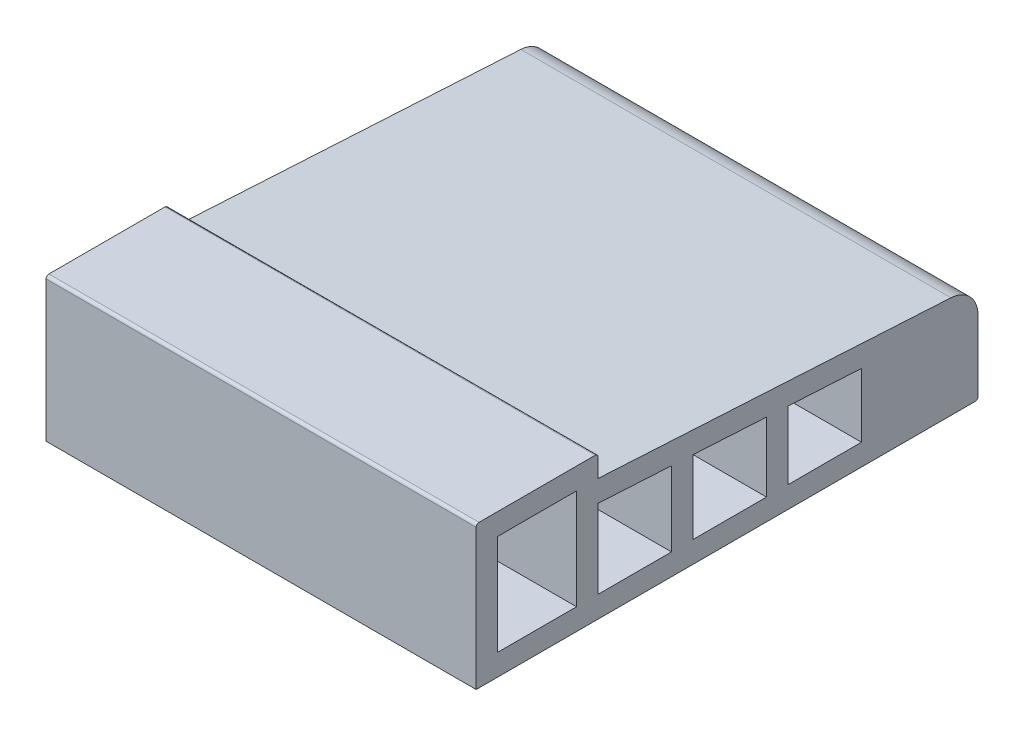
ISO-10303-21;
HEADER;
FILE_DESCRIPTION(('STEP AP214'),'2;1');
FILE_NAME('part.step','',(''),(''),'','','');
FILE_SCHEMA(('AUTOMOTIVE_DESIGN { 1 0 10303 214 1 1 1 1 }'));
ENDSEC;
DATA;
#1=APPLICATION_CONTEXT('core data for automotive mechanical design processes');
#2=APPLICATION_PROTOCOL_DEFINITION('international standard','automotive_design',2000,#1);
#3=PRODUCT_CONTEXT('',#1,'mechanical');
#4=PRODUCT('Part','Part','',(#3));
#5=PRODUCT_RELATED_PRODUCT_CATEGORY('part','',(#4));
#6=PRODUCT_DEFINITION_FORMATION('','',#4);
#7=PRODUCT_DEFINITION_CONTEXT('part definition',#1,'design');
#8=PRODUCT_DEFINITION('design','',#6,#7);
#9=PRODUCT_DEFINITION_SHAPE('','',#8);
#10=(LENGTH_UNIT() NAMED_UNIT(*) SI_UNIT(.MILLI.,.METRE.));
#11=(NAMED_UNIT(*) PLANE_ANGLE_UNIT() SI_UNIT($,.RADIAN.));
#12=(NAMED_UNIT(*) SI_UNIT($,.STERADIAN.) SOLID_ANGLE_UNIT());
#13=UNCERTAINTY_MEASURE_WITH_UNIT(LENGTH_MEASURE(1.E-05),#10,'distance_accuracy_value','');
#14=(GEOMETRIC_REPRESENTATION_CONTEXT(3) GLOBAL_UNCERTAINTY_ASSIGNED_CONTEXT((#13)) GLOBAL_UNIT_ASSIGNED_CONTEXT((#10,
#11,#12)) REPRESENTATION_CONTEXT('',''));
#15=CARTESIAN_POINT('',(0.,0.,0.));
#16=DIRECTION('',(0.,0.,1.));
#17=DIRECTION('',(1.,0.,0.));
#18=AXIS2_PLACEMENT_3D('',#15,#16,#17);
#19=CARTESIAN_POINT('',(30.,9.8,-8.3));
#20=DIRECTION('',(-1.,0.,0.));
#21=DIRECTION('',(0.,0.,1.));
#22=AXIS2_PLACEMENT_3D('',#19,#20,#21);
#23=PLANE('',#22);
#24=DIRECTION('',(0.,-1.,0.));
#25=VECTOR('',#24,1.);
#26=CARTESIAN_POINT('',(30.,1.5,-15.125));
#27=LINE('',#26,#25);
#28=CARTESIAN_POINT('',(30.,6.62259893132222,-15.125));
#29=VERTEX_POINT('',#28);
#30=CARTESIAN_POINT('',(30.,1.5,-15.125));
#31=VERTEX_POINT('',#30);
#32=EDGE_CURVE('E381',#29,#31,#27,.T.);
#33=ORIENTED_EDGE('',*,*,#32,.F.);
#34=DIRECTION('',(0.,0.0565133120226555,0.998401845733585));
#35=VECTOR('',#34,1.);
#36=CARTESIAN_POINT('',(30.,6.33250459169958,-20.25));
#37=LINE('',#36,#35);
#38=CARTESIAN_POINT('',(30.,6.33250459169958,-20.25));
#39=VERTEX_POINT('',#38);
#40=EDGE_CURVE('E375',#39,#29,#37,.T.);
#41=ORIENTED_EDGE('',*,*,#40,.F.);
#42=DIRECTION('',(0.,1.,0.));
#43=VECTOR('',#42,1.);
#44=CARTESIAN_POINT('',(30.,1.5,-20.25));
#45=LINE('',#44,#43);
#46=CARTESIAN_POINT('',(30.,1.5,-20.25));
#47=VERTEX_POINT('',#46);
#48=EDGE_CURVE('E394',#47,#39,#45,.T.);
#49=ORIENTED_EDGE('',*,*,#48,.F.);
#50=DIRECTION('',(0.,0.,-1.));
#51=VECTOR('',#50,1.);
#52=CARTESIAN_POINT('',(30.,1.5,-15.125));
#53=LINE('',#52,#51);
#54=EDGE_CURVE('E405',#31,#47,#53,.T.);
#55=ORIENTED_EDGE('',*,*,#54,.F.);
#56=EDGE_LOOP('',(#33,#41,#49,#55));
#57=FACE_BOUND('',#56,.T.);
#58=DIRECTION('',(0.,-1.,0.));
#59=VECTOR('',#58,1.);
#60=CARTESIAN_POINT('',(30.,8.5,-1.5));
#61=LINE('',#60,#59);
#62=CARTESIAN_POINT('',(30.,8.5,-1.5));
#63=VERTEX_POINT('',#62);
#64=CARTESIAN_POINT('',(30.,1.5,-1.5));
#65=VERTEX_POINT('',#64);
#66=EDGE_CURVE('E232',#63,#65,#61,.T.);
#67=ORIENTED_EDGE('',*,*,#66,.F.);
#68=DIRECTION('',(0.,0.,1.));
#69=VECTOR('',#68,1.);
#70=CARTESIAN_POINT('',(30.,8.5,-1.5));
#71=LINE('',#70,#69);
#72=CARTESIAN_POINT('',(30.,8.5,-7.));
#73=VERTEX_POINT('',#72);
#74=EDGE_CURVE('E240',#73,#63,#71,.T.);
#75=ORIENTED_EDGE('',*,*,#74,.F.);
#76=DIRECTION('',(0.,1.,0.));
#77=VECTOR('',#76,1.);
#78=CARTESIAN_POINT('',(30.,8.5,-7.));
#79=LINE('',#78,#77);
#80=CARTESIAN_POINT('',(30.,1.5,-7.));
#81=VERTEX_POINT('',#80);
#82=EDGE_CURVE('E237',#81,#73,#79,.T.);
#83=ORIENTED_EDGE('',*,*,#82,.F.);
#84=DIRECTION('',(0.,0.,-1.));
#85=VECTOR('',#84,1.);
#86=CARTESIAN_POINT('',(30.,1.5,-1.5));
#87=LINE('',#86,#85);
#88=EDGE_CURVE('E234',#65,#81,#87,.T.);
#89=ORIENTED_EDGE('',*,*,#88,.F.);
#90=EDGE_LOOP('',(#67,#75,#83,#89));
#91=FACE_BOUND('',#90,.T.);
#92=DIRECTION('',(0.,1.,0.));
#93=VECTOR('',#92,1.);
#94=CARTESIAN_POINT('',(30.,8.5,-8.5));
#95=LINE('',#94,#93);
#96=CARTESIAN_POINT('',(30.,8.5,-8.5));
#97=VERTEX_POINT('',#96);
#98=CARTESIAN_POINT('',(30.,9.8,-8.5));
#99=VERTEX_POINT('',#98);
#100=EDGE_CURVE('E265',#97,#99,#95,.T.);
#101=ORIENTED_EDGE('',*,*,#100,.T.);
#102=CARTESIAN_POINT('',(30.,9.8,-8.3));
#103=DIRECTION('',(1.,0.,0.));
#104=DIRECTION('',(0.,0.,1.));
#105=AXIS2_PLACEMENT_3D('',#102,#103,#104);
#106=CIRCLE('',#105,0.200000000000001);
#107=CARTESIAN_POINT('',(30.,10.,-8.3));
#108=VERTEX_POINT('',#107);
#109=EDGE_CURVE('E268',#99,#108,#106,.T.);
#110=ORIENTED_EDGE('',*,*,#109,.T.);
#111=DIRECTION('',(0.,0.,1.));
#112=VECTOR('',#111,1.);
#113=CARTESIAN_POINT('',(30.,10.,-0.200000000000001));
#114=LINE('',#113,#112);
#115=CARTESIAN_POINT('',(30.,10.,-0.200000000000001));
#116=VERTEX_POINT('',#115);
#117=EDGE_CURVE('E270',#108,#116,#114,.T.);
#118=ORIENTED_EDGE('',*,*,#117,.T.);
#119=CARTESIAN_POINT('',(30.,9.8,-0.2));
#120=DIRECTION('',(1.,0.,0.));
#121=DIRECTION('',(0.,0.,1.));
#122=AXIS2_PLACEMENT_3D('',#119,#120,#121);
#123=CIRCLE('',#122,0.2);
#124=CARTESIAN_POINT('',(30.,9.8,0.));
#125=VERTEX_POINT('',#124);
#126=EDGE_CURVE('E272',#116,#125,#123,.T.);
#127=ORIENTED_EDGE('',*,*,#126,.T.);
#128=DIRECTION('',(0.,-1.,0.));
#129=VECTOR('',#128,1.);
#130=CARTESIAN_POINT('',(30.,0.,0.));
#131=LINE('',#130,#129);
#132=CARTESIAN_POINT('',(30.,0.,0.));
#133=VERTEX_POINT('',#132);
#134=EDGE_CURVE('E274',#125,#133,#131,.T.);
#135=ORIENTED_EDGE('',*,*,#134,.T.);
#136=DIRECTION('',(0.,0.,-1.));
#137=VECTOR('',#136,1.);
#138=CARTESIAN_POINT('',(30.,0.,-34.8));
#139=LINE('',#138,#137);
#140=CARTESIAN_POINT('',(30.,0.,-34.8));
#141=VERTEX_POINT('',#140);
#142=EDGE_CURVE('E276',#133,#141,#139,.T.);
#143=ORIENTED_EDGE('',*,*,#142,.T.);
#144=CARTESIAN_POINT('',(30.,0.2,-34.8));
#145=DIRECTION('',(1.,0.,0.));
#146=DIRECTION('',(0.,0.,1.));
#147=AXIS2_PLACEMENT_3D('',#144,#145,#146);
#148=CIRCLE('',#147,0.199999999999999);
#149=CARTESIAN_POINT('',(30.,0.200000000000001,-35.));
#150=VERTEX_POINT('',#149);
#151=EDGE_CURVE('E278',#141,#150,#148,.T.);
#152=ORIENTED_EDGE('',*,*,#151,.T.);
#153=DIRECTION('',(0.,1.,0.));
#154=VECTOR('',#153,1.);
#155=CARTESIAN_POINT('',(30.,5.1100061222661,-35.));
#156=LINE('',#155,#154);
#157=CARTESIAN_POINT('',(30.,5.1100061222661,-35.));
#158=VERTEX_POINT('',#157);
#159=EDGE_CURVE('E280',#150,#158,#156,.T.);
#160=ORIENTED_EDGE('',*,*,#159,.T.);
#161=CARTESIAN_POINT('',(30.,5.11000612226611,-33.));
#162=DIRECTION('',(1.,0.,0.));
#163=DIRECTION('',(0.,0.,1.));
#164=AXIS2_PLACEMENT_3D('',#161,#162,#163);
#165=CIRCLE('',#164,2.);
#166=CARTESIAN_POINT('',(30.,7.10680981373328,-33.1130266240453));
#167=VERTEX_POINT('',#166);
#168=EDGE_CURVE('E282',#158,#167,#165,.T.);
#169=ORIENTED_EDGE('',*,*,#168,.T.);
#170=DIRECTION('',(0.,0.0565133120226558,0.998401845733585));
#171=VECTOR('',#170,1.);
#172=CARTESIAN_POINT('',(30.,8.5,-8.5));
#173=LINE('',#172,#171);
#174=EDGE_CURVE('E284',#167,#97,#173,.T.);
#175=ORIENTED_EDGE('',*,*,#174,.T.);
#176=EDGE_LOOP('',(#101,#110,#118,#127,#135,#143,#152,#160,#169,#175));
#177=FACE_BOUND('',#176,.T.);
#178=DIRECTION('',(0.,0.0565133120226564,0.998401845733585));
#179=VECTOR('',#178,1.);
#180=CARTESIAN_POINT('',(30.,6.70750459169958,-13.625));
#181=LINE('',#180,#179);
#182=CARTESIAN_POINT('',(30.,6.70750459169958,-13.625));
#183=VERTEX_POINT('',#182);
#184=CARTESIAN_POINT('',(30.,6.99759893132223,-8.5));
#185=VERTEX_POINT('',#184);
#186=EDGE_CURVE('E227',#183,#185,#181,.T.);
#187=ORIENTED_EDGE('',*,*,#186,.F.);
#188=DIRECTION('',(0.,1.,0.));
#189=VECTOR('',#188,1.);
#190=CARTESIAN_POINT('',(30.,1.5,-13.625));
#191=LINE('',#190,#189);
#192=CARTESIAN_POINT('',(30.,1.5,-13.625));
#193=VERTEX_POINT('',#192);
#194=EDGE_CURVE('E207',#193,#183,#191,.T.);
#195=ORIENTED_EDGE('',*,*,#194,.F.);
#196=DIRECTION('',(0.,0.,-1.));
#197=VECTOR('',#196,1.);
#198=CARTESIAN_POINT('',(30.,1.5,-8.5));
#199=LINE('',#198,#197);
#200=CARTESIAN_POINT('',(30.,1.5,-8.5));
#201=VERTEX_POINT('',#200);
#202=EDGE_CURVE('E219',#201,#193,#199,.T.);
#203=ORIENTED_EDGE('',*,*,#202,.F.);
#204=DIRECTION('',(0.,-1.,0.));
#205=VECTOR('',#204,1.);
#206=CARTESIAN_POINT('',(30.,1.5,-8.5));
#207=LINE('',#206,#205);
#208=EDGE_CURVE('E223',#185,#201,#207,.T.);
#209=ORIENTED_EDGE('',*,*,#208,.F.);
#210=EDGE_LOOP('',(#187,#195,#203,#209));
#211=FACE_BOUND('',#210,.T.);
#212=DIRECTION('',(0.,0.,-1.));
#213=VECTOR('',#212,1.);
#214=CARTESIAN_POINT('',(30.,1.5,-26.875));
#215=LINE('',#214,#213);
#216=CARTESIAN_POINT('',(30.,1.5,-21.75));
#217=VERTEX_POINT('',#216);
#218=CARTESIAN_POINT('',(30.,1.5,-26.875));
#219=VERTEX_POINT('',#218);
#220=EDGE_CURVE('E331',#217,#219,#215,.T.);
#221=ORIENTED_EDGE('',*,*,#220,.F.);
#222=DIRECTION('',(0.,-1.,0.));
#223=VECTOR('',#222,1.);
#224=CARTESIAN_POINT('',(30.,1.5,-21.75));
#225=LINE('',#224,#223);
#226=CARTESIAN_POINT('',(30.,6.24759893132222,-21.75));
#227=VERTEX_POINT('',#226);
#228=EDGE_CURVE('E111',#227,#217,#225,.T.);
#229=ORIENTED_EDGE('',*,*,#228,.F.);
#230=DIRECTION('',(0.,0.0565133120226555,0.998401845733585));
#231=VECTOR('',#230,1.);
#232=CARTESIAN_POINT('',(30.,5.95750459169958,-26.875));
#233=LINE('',#232,#231);
#234=CARTESIAN_POINT('',(30.,5.95750459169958,-26.875));
#235=VERTEX_POINT('',#234);
#236=EDGE_CURVE('E434',#235,#227,#233,.T.);
#237=ORIENTED_EDGE('',*,*,#236,.F.);
#238=DIRECTION('',(0.,1.,0.));
#239=VECTOR('',#238,1.);
#240=CARTESIAN_POINT('',(30.,1.5,-26.875));
#241=LINE('',#240,#239);
#242=EDGE_CURVE('E432',#219,#235,#241,.T.);
#243=ORIENTED_EDGE('',*,*,#242,.F.);
#244=EDGE_LOOP('',(#221,#229,#237,#243));
#245=FACE_BOUND('',#244,.T.);
#246=ADVANCED_FACE('F26',(#57,#91,#177,#211,#245),#23,.F.);
#247=CARTESIAN_POINT('',(0.,9.8,-8.3));
#248=DIRECTION('',(-1.,0.,0.));
#249=DIRECTION('',(0.,0.,1.));
#250=AXIS2_PLACEMENT_3D('',#247,#248,#249);
#251=PLANE('',#250);
#252=DIRECTION('',(0.,0.0565133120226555,0.998401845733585));
#253=VECTOR('',#252,1.);
#254=CARTESIAN_POINT('',(0.,6.49501863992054,-8.11292558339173));
#255=LINE('',#254,#253);
#256=CARTESIAN_POINT('',(0.,5.8376551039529,-19.7263480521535));
#257=VERTEX_POINT('',#256);
#258=CARTESIAN_POINT('',(0.,6.06846809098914,-15.6486519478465));
#259=VERTEX_POINT('',#258);
#260=EDGE_CURVE('E379',#257,#259,#255,.T.);
#261=ORIENTED_EDGE('',*,*,#260,.T.);
#262=DIRECTION('',(0.,-1.,0.));
#263=VECTOR('',#262,1.);
#264=CARTESIAN_POINT('',(0.,9.8,-15.6486519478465));
#265=LINE('',#264,#263);
#266=CARTESIAN_POINT('',(0.,2.02365194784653,-15.6486519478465));
#267=VERTEX_POINT('',#266);
#268=EDGE_CURVE('E315',#259,#267,#265,.T.);
#269=ORIENTED_EDGE('',*,*,#268,.T.);
#270=DIRECTION('',(0.,0.,-1.));
#271=VECTOR('',#270,1.);
#272=CARTESIAN_POINT('',(0.,2.02365194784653,-8.3));
#273=LINE('',#272,#271);
#274=CARTESIAN_POINT('',(0.,2.02365194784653,-19.7263480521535));
#275=VERTEX_POINT('',#274);
#276=EDGE_CURVE('E30',#267,#275,#273,.T.);
#277=ORIENTED_EDGE('',*,*,#276,.T.);
#278=DIRECTION('',(0.,1.,0.));
#279=VECTOR('',#278,1.);
#280=CARTESIAN_POINT('',(0.,9.8,-19.7263480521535));
#281=LINE('',#280,#279);
#282=EDGE_CURVE('E376',#275,#257,#281,.T.);
#283=ORIENTED_EDGE('',*,*,#282,.T.);
#284=EDGE_LOOP('',(#261,#269,#277,#283));
#285=FACE_BOUND('',#284,.T.);
#286=DIRECTION('',(0.,0.,1.));
#287=VECTOR('',#286,1.);
#288=CARTESIAN_POINT('',(0.,7.97634805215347,-8.3));
#289=LINE('',#288,#287);
#290=CARTESIAN_POINT('',(0.,7.97634805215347,-6.47634805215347));
#291=VERTEX_POINT('',#290);
#292=CARTESIAN_POINT('',(0.,7.97634805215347,-2.02365194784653));
#293=VERTEX_POINT('',#292);
#294=EDGE_CURVE('E235',#291,#293,#289,.T.);
#295=ORIENTED_EDGE('',*,*,#294,.T.);
#296=DIRECTION('',(0.,-1.,0.));
#297=VECTOR('',#296,1.);
#298=CARTESIAN_POINT('',(0.,9.8,-2.02365194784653));
#299=LINE('',#298,#297);
#300=CARTESIAN_POINT('',(0.,2.02365194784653,-2.02365194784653));
#301=VERTEX_POINT('',#300);
#302=EDGE_CURVE('E348',#293,#301,#299,.T.);
#303=ORIENTED_EDGE('',*,*,#302,.T.);
#304=DIRECTION('',(0.,0.,-1.));
#305=VECTOR('',#304,1.);
#306=CARTESIAN_POINT('',(0.,2.02365194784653,-8.3));
#307=LINE('',#306,#305);
#308=CARTESIAN_POINT('',(0.,2.02365194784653,-6.47634805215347));
#309=VERTEX_POINT('',#308);
#310=EDGE_CURVE('E345',#301,#309,#307,.T.);
#311=ORIENTED_EDGE('',*,*,#310,.T.);
#312=DIRECTION('',(0.,1.,0.));
#313=VECTOR('',#312,1.);
#314=CARTESIAN_POINT('',(0.,9.8,-6.47634805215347));
#315=LINE('',#314,#313);
#316=EDGE_CURVE('E342',#309,#291,#315,.T.);
#317=ORIENTED_EDGE('',*,*,#316,.T.);
#318=EDGE_LOOP('',(#295,#303,#311,#317));
#319=FACE_BOUND('',#318,.T.);
#320=DIRECTION('',(0.,1.,0.));
#321=VECTOR('',#320,1.);
#322=CARTESIAN_POINT('',(0.,8.5,-8.5));
#323=LINE('',#322,#321);
#324=CARTESIAN_POINT('',(0.,8.5,-8.5));
#325=VERTEX_POINT('',#324);
#326=CARTESIAN_POINT('',(0.,9.8,-8.5));
#327=VERTEX_POINT('',#326);
#328=EDGE_CURVE('E243',#325,#327,#323,.T.);
#329=ORIENTED_EDGE('',*,*,#328,.F.);
#330=DIRECTION('',(0.,0.0565133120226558,0.998401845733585));
#331=VECTOR('',#330,1.);
#332=CARTESIAN_POINT('',(0.,8.5,-8.5));
#333=LINE('',#332,#331);
#334=CARTESIAN_POINT('',(0.,7.10680981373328,-33.1130266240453));
#335=VERTEX_POINT('',#334);
#336=EDGE_CURVE('E263',#335,#325,#333,.T.);
#337=ORIENTED_EDGE('',*,*,#336,.F.);
#338=CARTESIAN_POINT('',(0.,5.11000612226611,-33.));
#339=DIRECTION('',(1.,0.,0.));
#340=DIRECTION('',(0.,0.,1.));
#341=AXIS2_PLACEMENT_3D('',#338,#339,#340);
#342=CIRCLE('',#341,2.);
#343=CARTESIAN_POINT('',(0.,5.1100061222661,-35.));
#344=VERTEX_POINT('',#343);
#345=EDGE_CURVE('E261',#344,#335,#342,.T.);
#346=ORIENTED_EDGE('',*,*,#345,.F.);
#347=DIRECTION('',(0.,1.,0.));
#348=VECTOR('',#347,1.);
#349=CARTESIAN_POINT('',(0.,5.1100061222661,-35.));
#350=LINE('',#349,#348);
#351=CARTESIAN_POINT('',(0.,0.200000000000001,-35.));
#352=VERTEX_POINT('',#351);
#353=EDGE_CURVE('E259',#352,#344,#350,.T.);
#354=ORIENTED_EDGE('',*,*,#353,.F.);
#355=CARTESIAN_POINT('',(0.,0.2,-34.8));
#356=DIRECTION('',(1.,0.,0.));
#357=DIRECTION('',(0.,0.,1.));
#358=AXIS2_PLACEMENT_3D('',#355,#356,#357);
#359=CIRCLE('',#358,0.199999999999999);
#360=CARTESIAN_POINT('',(0.,0.,-34.8));
#361=VERTEX_POINT('',#360);
#362=EDGE_CURVE('E257',#361,#352,#359,.T.);
#363=ORIENTED_EDGE('',*,*,#362,.F.);
#364=DIRECTION('',(0.,0.,-1.));
#365=VECTOR('',#364,1.);
#366=CARTESIAN_POINT('',(0.,0.,-34.8));
#367=LINE('',#366,#365);
#368=CARTESIAN_POINT('',(0.,0.,0.));
#369=VERTEX_POINT('',#368);
#370=EDGE_CURVE('E255',#369,#361,#367,.T.);
#371=ORIENTED_EDGE('',*,*,#370,.F.);
#372=DIRECTION('',(0.,-1.,0.));
#373=VECTOR('',#372,1.);
#374=CARTESIAN_POINT('',(0.,0.,0.));
#375=LINE('',#374,#373);
#376=CARTESIAN_POINT('',(0.,9.8,0.));
#377=VERTEX_POINT('',#376);
#378=EDGE_CURVE('E253',#377,#369,#375,.T.);
#379=ORIENTED_EDGE('',*,*,#378,.F.);
#380=CARTESIAN_POINT('',(0.,9.8,-0.2));
#381=DIRECTION('',(1.,0.,0.));
#382=DIRECTION('',(0.,0.,1.));
#383=AXIS2_PLACEMENT_3D('',#380,#381,#382);
#384=CIRCLE('',#383,0.2);
#385=CARTESIAN_POINT('',(0.,10.,-0.200000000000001));
#386=VERTEX_POINT('',#385);
#387=EDGE_CURVE('E251',#386,#377,#384,.T.);
#388=ORIENTED_EDGE('',*,*,#387,.F.);
#389=DIRECTION('',(0.,0.,1.));
#390=VECTOR('',#389,1.);
#391=CARTESIAN_POINT('',(0.,10.,-0.200000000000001));
#392=LINE('',#391,#390);
#393=CARTESIAN_POINT('',(0.,10.,-8.3));
#394=VERTEX_POINT('',#393);
#395=EDGE_CURVE('E249',#394,#386,#392,.T.);
#396=ORIENTED_EDGE('',*,*,#395,.F.);
#397=CARTESIAN_POINT('',(0.,9.8,-8.3));
#398=DIRECTION('',(1.,0.,0.));
#399=DIRECTION('',(0.,0.,1.));
#400=AXIS2_PLACEMENT_3D('',#397,#398,#399);
#401=CIRCLE('',#400,0.200000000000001);
#402=EDGE_CURVE('E246',#327,#394,#401,.T.);
#403=ORIENTED_EDGE('',*,*,#402,.F.);
#404=EDGE_LOOP('',(#329,#337,#346,#354,#363,#371,#379,#388,#396,#403));
#405=FACE_BOUND('',#404,.T.);
#406=DIRECTION('',(0.,1.,0.));
#407=VECTOR('',#406,1.);
#408=CARTESIAN_POINT('',(0.,9.8,-13.1013480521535));
#409=LINE('',#408,#407);
#410=CARTESIAN_POINT('',(0.,2.02365194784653,-13.1013480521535));
#411=VERTEX_POINT('',#410);
#412=CARTESIAN_POINT('',(0.,6.2126551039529,-13.1013480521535));
#413=VERTEX_POINT('',#412);
#414=EDGE_CURVE('E210',#411,#413,#409,.T.);
#415=ORIENTED_EDGE('',*,*,#414,.T.);
#416=DIRECTION('',(0.,0.0565133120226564,0.998401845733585));
#417=VECTOR('',#416,1.);
#418=CARTESIAN_POINT('',(0.,6.49501863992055,-8.11292558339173));
#419=LINE('',#418,#417);
#420=CARTESIAN_POINT('',(0.,6.44346809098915,-9.02365194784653));
#421=VERTEX_POINT('',#420);
#422=EDGE_CURVE('E359',#413,#421,#419,.T.);
#423=ORIENTED_EDGE('',*,*,#422,.T.);
#424=DIRECTION('',(0.,-1.,0.));
#425=VECTOR('',#424,1.);
#426=CARTESIAN_POINT('',(0.,9.8,-9.02365194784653));
#427=LINE('',#426,#425);
#428=CARTESIAN_POINT('',(0.,2.02365194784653,-9.02365194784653));
#429=VERTEX_POINT('',#428);
#430=EDGE_CURVE('E362',#421,#429,#427,.T.);
#431=ORIENTED_EDGE('',*,*,#430,.T.);
#432=DIRECTION('',(0.,0.,-1.));
#433=VECTOR('',#432,1.);
#434=CARTESIAN_POINT('',(0.,2.02365194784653,-8.3));
#435=LINE('',#434,#433);
#436=EDGE_CURVE('E358',#429,#411,#435,.T.);
#437=ORIENTED_EDGE('',*,*,#436,.T.);
#438=EDGE_LOOP('',(#415,#423,#431,#437));
#439=FACE_BOUND('',#438,.T.);
#440=DIRECTION('',(0.,-1.,0.));
#441=VECTOR('',#440,1.);
#442=CARTESIAN_POINT('',(0.,9.8,-22.2736519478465));
#443=LINE('',#442,#441);
#444=CARTESIAN_POINT('',(0.,5.69346809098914,-22.2736519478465));
#445=VERTEX_POINT('',#444);
#446=CARTESIAN_POINT('',(0.,2.02365194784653,-22.2736519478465));
#447=VERTEX_POINT('',#446);
#448=EDGE_CURVE('E328',#445,#447,#443,.T.);
#449=ORIENTED_EDGE('',*,*,#448,.T.);
#450=DIRECTION('',(0.,0.,-1.));
#451=VECTOR('',#450,1.);
#452=CARTESIAN_POINT('',(0.,2.02365194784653,-8.3));
#453=LINE('',#452,#451);
#454=CARTESIAN_POINT('',(0.,2.02365194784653,-26.3513480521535));
#455=VERTEX_POINT('',#454);
#456=EDGE_CURVE('E325',#447,#455,#453,.T.);
#457=ORIENTED_EDGE('',*,*,#456,.T.);
#458=DIRECTION('',(0.,1.,0.));
#459=VECTOR('',#458,1.);
#460=CARTESIAN_POINT('',(0.,9.80000000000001,-26.3513480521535));
#461=LINE('',#460,#459);
#462=CARTESIAN_POINT('',(0.,5.4626551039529,-26.3513480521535));
#463=VERTEX_POINT('',#462);
#464=EDGE_CURVE('E321',#455,#463,#461,.T.);
#465=ORIENTED_EDGE('',*,*,#464,.T.);
#466=DIRECTION('',(0.,0.0565133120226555,0.998401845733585));
#467=VECTOR('',#466,1.);
#468=CARTESIAN_POINT('',(0.,6.49501863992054,-8.11292558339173));
#469=LINE('',#468,#467);
#470=EDGE_CURVE('E324',#463,#445,#469,.T.);
#471=ORIENTED_EDGE('',*,*,#470,.T.);
#472=EDGE_LOOP('',(#449,#457,#465,#471));
#473=FACE_BOUND('',#472,.T.);
#474=ADVANCED_FACE('F384',(#285,#319,#405,#439,#473),#251,.T.);
#475=CARTESIAN_POINT('',(30.,8.5,-8.5));
#476=DIRECTION('',(0.,0.,1.));
#477=DIRECTION('',(0.,-1.,0.));
#478=AXIS2_PLACEMENT_3D('',#475,#476,#477);
#479=PLANE('',#478);
#480=ORIENTED_EDGE('',*,*,#328,.T.);
#481=DIRECTION('',(-1.,0.,0.));
#482=VECTOR('',#481,1.);
#483=CARTESIAN_POINT('',(30.,9.8,-8.5));
#484=LINE('',#483,#482);
#485=EDGE_CURVE('E11',#99,#327,#484,.T.);
#486=ORIENTED_EDGE('',*,*,#485,.F.);
#487=ORIENTED_EDGE('',*,*,#100,.F.);
#488=DIRECTION('',(-1.,0.,0.));
#489=VECTOR('',#488,1.);
#490=CARTESIAN_POINT('',(30.,8.5,-8.5));
#491=LINE('',#490,#489);
#492=EDGE_CURVE('E286',#97,#325,#491,.T.);
#493=ORIENTED_EDGE('',*,*,#492,.T.);
#494=EDGE_LOOP('',(#480,#486,#487,#493));
#495=FACE_BOUND('',#494,.T.);
#496=ADVANCED_FACE('F421',(#495),#479,.F.);
#497=CARTESIAN_POINT('',(30.,9.8,-8.3));
#498=DIRECTION('',(-1.,0.,0.));
#499=DIRECTION('',(0.,0.,1.));
#500=AXIS2_PLACEMENT_3D('',#497,#498,#499);
#501=CYLINDRICAL_SURFACE('',#500,0.200000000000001);
#502=ORIENTED_EDGE('',*,*,#402,.T.);
#503=DIRECTION('',(-1.,0.,0.));
#504=VECTOR('',#503,1.);
#505=CARTESIAN_POINT('',(30.,10.,-8.3));
#506=LINE('',#505,#504);
#507=EDGE_CURVE('E36',#108,#394,#506,.T.);
#508=ORIENTED_EDGE('',*,*,#507,.F.);
#509=ORIENTED_EDGE('',*,*,#109,.F.);
#510=ORIENTED_EDGE('',*,*,#485,.T.);
#511=EDGE_LOOP('',(#502,#508,#509,#510));
#512=FACE_BOUND('',#511,.T.);
#513=ADVANCED_FACE('F487',(#512),#501,.T.);
#514=CARTESIAN_POINT('',(30.,10.,-0.200000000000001));
#515=DIRECTION('',(0.,-1.,0.));
#516=DIRECTION('',(0.,0.,-1.));
#517=AXIS2_PLACEMENT_3D('',#514,#515,#516);
#518=PLANE('',#517);
#519=ORIENTED_EDGE('',*,*,#395,.T.);
#520=DIRECTION('',(-1.,0.,0.));
#521=VECTOR('',#520,1.);
#522=CARTESIAN_POINT('',(30.,10.,-0.200000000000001));
#523=LINE('',#522,#521);
#524=EDGE_CURVE('E307',#116,#386,#523,.T.);
#525=ORIENTED_EDGE('',*,*,#524,.F.);
#526=ORIENTED_EDGE('',*,*,#117,.F.);
#527=ORIENTED_EDGE('',*,*,#507,.T.);
#528=EDGE_LOOP('',(#519,#525,#526,#527));
#529=FACE_BOUND('',#528,.T.);
#530=ADVANCED_FACE('F483',(#529),#518,.F.);
#531=CARTESIAN_POINT('',(30.,9.8,-0.2));
#532=DIRECTION('',(-1.,0.,0.));
#533=DIRECTION('',(0.,0.,1.));
#534=AXIS2_PLACEMENT_3D('',#531,#532,#533);
#535=CYLINDRICAL_SURFACE('',#534,0.2);
#536=ORIENTED_EDGE('',*,*,#387,.T.);
#537=DIRECTION('',(-1.,0.,0.));
#538=VECTOR('',#537,1.);
#539=CARTESIAN_POINT('',(30.,9.8,0.));
#540=LINE('',#539,#538);
#541=EDGE_CURVE('E304',#125,#377,#540,.T.);
#542=ORIENTED_EDGE('',*,*,#541,.F.);
#543=ORIENTED_EDGE('',*,*,#126,.F.);
#544=ORIENTED_EDGE('',*,*,#524,.T.);
#545=EDGE_LOOP('',(#536,#542,#543,#544));
#546=FACE_BOUND('',#545,.T.);
#547=ADVANCED_FACE('F479',(#546),#535,.T.);
#548=CARTESIAN_POINT('',(30.,0.,0.));
#549=DIRECTION('',(0.,0.,-1.));
#550=DIRECTION('',(-1.,0.,0.));
#551=AXIS2_PLACEMENT_3D('',#548,#549,#550);
#552=PLANE('',#551);
#553=ORIENTED_EDGE('',*,*,#378,.T.);
#554=DIRECTION('',(-1.,0.,0.));
#555=VECTOR('',#554,1.);
#556=CARTESIAN_POINT('',(30.,0.,0.));
#557=LINE('',#556,#555);
#558=EDGE_CURVE('E301',#133,#369,#557,.T.);
#559=ORIENTED_EDGE('',*,*,#558,.F.);
#560=ORIENTED_EDGE('',*,*,#134,.F.);
#561=ORIENTED_EDGE('',*,*,#541,.T.);
#562=EDGE_LOOP('',(#553,#559,#560,#561));
#563=FACE_BOUND('',#562,.T.);
#564=ADVANCED_FACE('F475',(#563),#552,.F.);
#565=CARTESIAN_POINT('',(30.,0.,-34.8));
#566=DIRECTION('',(0.,1.,0.));
#567=DIRECTION('',(0.,0.,1.));
#568=AXIS2_PLACEMENT_3D('',#565,#566,#567);
#569=PLANE('',#568);
#570=ORIENTED_EDGE('',*,*,#370,.T.);
#571=DIRECTION('',(-1.,0.,0.));
#572=VECTOR('',#571,1.);
#573=CARTESIAN_POINT('',(30.,0.,-34.8));
#574=LINE('',#573,#572);
#575=EDGE_CURVE('E298',#141,#361,#574,.T.);
#576=ORIENTED_EDGE('',*,*,#575,.F.);
#577=ORIENTED_EDGE('',*,*,#142,.F.);
#578=ORIENTED_EDGE('',*,*,#558,.T.);
#579=EDGE_LOOP('',(#570,#576,#577,#578));
#580=FACE_BOUND('',#579,.T.);
#581=ADVANCED_FACE('F471',(#580),#569,.F.);
#582=CARTESIAN_POINT('',(30.,0.2,-34.8));
#583=DIRECTION('',(-1.,0.,0.));
#584=DIRECTION('',(0.,0.,1.));
#585=AXIS2_PLACEMENT_3D('',#582,#583,#584);
#586=CYLINDRICAL_SURFACE('',#585,0.199999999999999);
#587=ORIENTED_EDGE('',*,*,#362,.T.);
#588=DIRECTION('',(-1.,0.,0.));
#589=VECTOR('',#588,1.);
#590=CARTESIAN_POINT('',(30.,0.200000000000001,-35.));
#591=LINE('',#590,#589);
#592=EDGE_CURVE('E295',#150,#352,#591,.T.);
#593=ORIENTED_EDGE('',*,*,#592,.F.);
#594=ORIENTED_EDGE('',*,*,#151,.F.);
#595=ORIENTED_EDGE('',*,*,#575,.T.);
#596=EDGE_LOOP('',(#587,#593,#594,#595));
#597=FACE_BOUND('',#596,.T.);
#598=ADVANCED_FACE('F467',(#597),#586,.T.);
#599=CARTESIAN_POINT('',(30.,5.1100061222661,-35.));
#600=DIRECTION('',(0.,0.,1.));
#601=DIRECTION('',(1.,0.,0.));
#602=AXIS2_PLACEMENT_3D('',#599,#600,#601);
#603=PLANE('',#602);
#604=ORIENTED_EDGE('',*,*,#353,.T.);
#605=DIRECTION('',(-1.,0.,0.));
#606=VECTOR('',#605,1.);
#607=CARTESIAN_POINT('',(30.,5.1100061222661,-35.));
#608=LINE('',#607,#606);
#609=EDGE_CURVE('E292',#158,#344,#608,.T.);
#610=ORIENTED_EDGE('',*,*,#609,.F.);
#611=ORIENTED_EDGE('',*,*,#159,.F.);
#612=ORIENTED_EDGE('',*,*,#592,.T.);
#613=EDGE_LOOP('',(#604,#610,#611,#612));
#614=FACE_BOUND('',#613,.T.);
#615=ADVANCED_FACE('F463',(#614),#603,.F.);
#616=CARTESIAN_POINT('',(30.,5.11000612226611,-33.));
#617=DIRECTION('',(-1.,0.,0.));
#618=DIRECTION('',(0.,0.,1.));
#619=AXIS2_PLACEMENT_3D('',#616,#617,#618);
#620=CYLINDRICAL_SURFACE('',#619,2.);
#621=ORIENTED_EDGE('',*,*,#345,.T.);
#622=DIRECTION('',(-1.,0.,0.));
#623=VECTOR('',#622,1.);
#624=CARTESIAN_POINT('',(30.,7.10680981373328,-33.1130266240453));
#625=LINE('',#624,#623);
#626=EDGE_CURVE('E289',#167,#335,#625,.T.);
#627=ORIENTED_EDGE('',*,*,#626,.F.);
#628=ORIENTED_EDGE('',*,*,#168,.F.);
#629=ORIENTED_EDGE('',*,*,#609,.T.);
#630=EDGE_LOOP('',(#621,#627,#628,#629));
#631=FACE_BOUND('',#630,.T.);
#632=ADVANCED_FACE('F459',(#631),#620,.T.);
#633=CARTESIAN_POINT('',(30.,8.5,-8.5));
#634=DIRECTION('',(0.,-0.998401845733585,0.0565133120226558));
#635=DIRECTION('',(0.,-0.0565133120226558,-0.998401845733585));
#636=AXIS2_PLACEMENT_3D('',#633,#634,#635);
#637=PLANE('',#636);
#638=ORIENTED_EDGE('',*,*,#336,.T.);
#639=ORIENTED_EDGE('',*,*,#492,.F.);
#640=ORIENTED_EDGE('',*,*,#174,.F.);
#641=ORIENTED_EDGE('',*,*,#626,.T.);
#642=EDGE_LOOP('',(#638,#639,#640,#641));
#643=FACE_BOUND('',#642,.T.);
#644=ADVANCED_FACE('F456',(#643),#637,.F.);
#645=CARTESIAN_POINT('',(30.,8.5,-1.5));
#646=DIRECTION('',(0.0174524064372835,0.,-0.999847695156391));
#647=DIRECTION('',(-0.999847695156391,0.,-0.0174524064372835));
#648=AXIS2_PLACEMENT_3D('',#645,#646,#647);
#649=PLANE('',#648);
#650=ORIENTED_EDGE('',*,*,#302,.F.);
#651=DIRECTION('',(-0.999695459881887,-0.0174497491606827,-0.0174497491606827));
#652=VECTOR('',#651,1.);
#653=CARTESIAN_POINT('',(30.,8.5,-1.5));
#654=LINE('',#653,#652);
#655=EDGE_CURVE('E242',#63,#293,#654,.T.);
#656=ORIENTED_EDGE('',*,*,#655,.F.);
#657=ORIENTED_EDGE('',*,*,#66,.T.);
#658=DIRECTION('',(-0.999695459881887,0.0174497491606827,-0.0174497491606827));
#659=VECTOR('',#658,1.);
#660=CARTESIAN_POINT('',(30.,1.5,-1.5));
#661=LINE('',#660,#659);
#662=EDGE_CURVE('E247',#65,#301,#661,.T.);
#663=ORIENTED_EDGE('',*,*,#662,.T.);
#664=EDGE_LOOP('',(#650,#656,#657,#663));
#665=FACE_BOUND('',#664,.T.);
#666=ADVANCED_FACE('F28',(#665),#649,.T.);
#667=CARTESIAN_POINT('',(30.,1.5,-1.5));
#668=DIRECTION('',(0.0174524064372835,0.999847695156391,0.));
#669=DIRECTION('',(-0.999847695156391,0.0174524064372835,0.));
#670=AXIS2_PLACEMENT_3D('',#667,#668,#669);
#671=PLANE('',#670);
#672=ORIENTED_EDGE('',*,*,#310,.F.);
#673=ORIENTED_EDGE('',*,*,#662,.F.);
#674=ORIENTED_EDGE('',*,*,#88,.T.);
#675=DIRECTION('',(-0.999695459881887,0.0174497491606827,0.0174497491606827));
#676=VECTOR('',#675,1.);
#677=CARTESIAN_POINT('',(29.8778889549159,1.5021314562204,-6.99786854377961));
#678=LINE('',#677,#676);
#679=EDGE_CURVE('E334',#81,#309,#678,.T.);
#680=ORIENTED_EDGE('',*,*,#679,.T.);
#681=EDGE_LOOP('',(#672,#673,#674,#680));
#682=FACE_BOUND('',#681,.T.);
#683=ADVANCED_FACE('F570',(#682),#671,.T.);
#684=CARTESIAN_POINT('',(30.,8.5,-7.));
#685=DIRECTION('',(0.0174524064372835,0.,0.999847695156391));
#686=DIRECTION('',(0.999847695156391,0.,-0.0174524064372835));
#687=AXIS2_PLACEMENT_3D('',#684,#685,#686);
#688=PLANE('',#687);
#689=ORIENTED_EDGE('',*,*,#316,.F.);
#690=ORIENTED_EDGE('',*,*,#679,.F.);
#691=ORIENTED_EDGE('',*,*,#82,.T.);
#692=DIRECTION('',(-0.999695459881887,-0.0174497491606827,0.0174497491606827));
#693=VECTOR('',#692,1.);
#694=CARTESIAN_POINT('',(29.9040556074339,8.49832528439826,-6.99832528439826));
#695=LINE('',#694,#693);
#696=EDGE_CURVE('E336',#73,#291,#695,.T.);
#697=ORIENTED_EDGE('',*,*,#696,.T.);
#698=EDGE_LOOP('',(#689,#690,#691,#697));
#699=FACE_BOUND('',#698,.T.);
#700=ADVANCED_FACE('F577',(#699),#688,.T.);
#701=CARTESIAN_POINT('',(30.,8.5,-1.5));
#702=DIRECTION('',(0.0174524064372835,-0.999847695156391,0.));
#703=DIRECTION('',(0.999847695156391,0.0174524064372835,0.));
#704=AXIS2_PLACEMENT_3D('',#701,#702,#703);
#705=PLANE('',#704);
#706=ORIENTED_EDGE('',*,*,#294,.F.);
#707=ORIENTED_EDGE('',*,*,#696,.F.);
#708=ORIENTED_EDGE('',*,*,#74,.T.);
#709=ORIENTED_EDGE('',*,*,#655,.T.);
#710=EDGE_LOOP('',(#706,#707,#708,#709));
#711=FACE_BOUND('',#710,.T.);
#712=ADVANCED_FACE('F585',(#711),#705,.T.);
#713=CARTESIAN_POINT('',(30.,6.70750459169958,-13.625));
#714=DIRECTION('',(0.0174524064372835,-0.998249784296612,0.0565047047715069));
#715=DIRECTION('',(0.,-0.0565133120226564,-0.998401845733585));
#716=AXIS2_PLACEMENT_3D('',#713,#714,#715);
#717=PLANE('',#716);
#718=ORIENTED_EDGE('',*,*,#422,.F.);
#719=DIRECTION('',(-0.999711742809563,-0.0164902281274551,0.0174500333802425));
#720=VECTOR('',#719,1.);
#721=CARTESIAN_POINT('',(30.,6.70750459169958,-13.625));
#722=LINE('',#721,#720);
#723=EDGE_CURVE('E215',#183,#413,#722,.T.);
#724=ORIENTED_EDGE('',*,*,#723,.F.);
#725=ORIENTED_EDGE('',*,*,#186,.T.);
#726=DIRECTION('',(-0.999677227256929,-0.0184650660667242,-0.0174494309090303));
#727=VECTOR('',#726,1.);
#728=CARTESIAN_POINT('',(29.8985192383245,6.99572447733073,-8.50177135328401));
#729=LINE('',#728,#727);
#730=EDGE_CURVE('E351',#185,#421,#729,.T.);
#731=ORIENTED_EDGE('',*,*,#730,.T.);
#732=EDGE_LOOP('',(#718,#724,#725,#731));
#733=FACE_BOUND('',#732,.T.);
#734=ADVANCED_FACE('F417',(#733),#717,.T.);
#735=CARTESIAN_POINT('',(30.,1.5,-8.5));
#736=DIRECTION('',(0.0174524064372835,0.,-0.999847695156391));
#737=DIRECTION('',(-0.999847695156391,0.,-0.0174524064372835));
#738=AXIS2_PLACEMENT_3D('',#735,#736,#737);
#739=PLANE('',#738);
#740=ORIENTED_EDGE('',*,*,#430,.F.);
#741=ORIENTED_EDGE('',*,*,#730,.F.);
#742=ORIENTED_EDGE('',*,*,#208,.T.);
#743=DIRECTION('',(-0.999695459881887,0.0174497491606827,-0.0174497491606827));
#744=VECTOR('',#743,1.);
#745=CARTESIAN_POINT('',(30.,1.5,-8.5));
#746=LINE('',#745,#744);
#747=EDGE_CURVE('E214',#201,#429,#746,.T.);
#748=ORIENTED_EDGE('',*,*,#747,.T.);
#749=EDGE_LOOP('',(#740,#741,#742,#748));
#750=FACE_BOUND('',#749,.T.);
#751=ADVANCED_FACE('F415',(#750),#739,.T.);
#752=CARTESIAN_POINT('',(30.,1.5,-8.5));
#753=DIRECTION('',(0.0174524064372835,0.999847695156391,0.));
#754=DIRECTION('',(-0.999847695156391,0.0174524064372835,0.));
#755=AXIS2_PLACEMENT_3D('',#752,#753,#754);
#756=PLANE('',#755);
#757=ORIENTED_EDGE('',*,*,#436,.F.);
#758=ORIENTED_EDGE('',*,*,#747,.F.);
#759=ORIENTED_EDGE('',*,*,#202,.T.);
#760=DIRECTION('',(-0.999695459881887,0.0174497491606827,0.0174497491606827));
#761=VECTOR('',#760,1.);
#762=CARTESIAN_POINT('',(30.,1.5,-13.625));
#763=LINE('',#762,#761);
#764=EDGE_CURVE('E202',#193,#411,#763,.T.);
#765=ORIENTED_EDGE('',*,*,#764,.T.);
#766=EDGE_LOOP('',(#757,#758,#759,#765));
#767=FACE_BOUND('',#766,.T.);
#768=ADVANCED_FACE('F220',(#767),#756,.T.);
#769=CARTESIAN_POINT('',(30.,1.5,-13.625));
#770=DIRECTION('',(0.0174524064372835,0.,0.999847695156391));
#771=DIRECTION('',(0.999847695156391,0.,-0.0174524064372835));
#772=AXIS2_PLACEMENT_3D('',#769,#770,#771);
#773=PLANE('',#772);
#774=ORIENTED_EDGE('',*,*,#414,.F.);
#775=ORIENTED_EDGE('',*,*,#764,.F.);
#776=ORIENTED_EDGE('',*,*,#194,.T.);
#777=ORIENTED_EDGE('',*,*,#723,.T.);
#778=EDGE_LOOP('',(#774,#775,#776,#777));
#779=FACE_BOUND('',#778,.T.);
#780=ADVANCED_FACE('F204',(#779),#773,.T.);
#781=CARTESIAN_POINT('',(30.,1.5,-15.125));
#782=DIRECTION('',(0.0174524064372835,0.,-0.999847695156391));
#783=DIRECTION('',(-0.999847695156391,0.,-0.0174524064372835));
#784=AXIS2_PLACEMENT_3D('',#781,#782,#783);
#785=PLANE('',#784);
#786=ORIENTED_EDGE('',*,*,#268,.F.);
#787=DIRECTION('',(-0.999677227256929,-0.0184650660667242,-0.0174494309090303));
#788=VECTOR('',#787,1.);
#789=CARTESIAN_POINT('',(29.905441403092,6.62085233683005,-15.1266505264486));
#790=LINE('',#789,#788);
#791=EDGE_CURVE('E371',#29,#259,#790,.T.);
#792=ORIENTED_EDGE('',*,*,#791,.F.);
#793=ORIENTED_EDGE('',*,*,#32,.T.);
#794=DIRECTION('',(-0.999695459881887,0.0174497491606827,-0.0174497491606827));
#795=VECTOR('',#794,1.);
#796=CARTESIAN_POINT('',(30.,1.5,-15.125));
#797=LINE('',#796,#795);
#798=EDGE_CURVE('E363',#31,#267,#797,.T.);
#799=ORIENTED_EDGE('',*,*,#798,.T.);
#800=EDGE_LOOP('',(#786,#792,#793,#799));
#801=FACE_BOUND('',#800,.T.);
#802=ADVANCED_FACE('F401',(#801),#785,.T.);
#803=CARTESIAN_POINT('',(30.,1.5,-15.125));
#804=DIRECTION('',(0.0174524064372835,0.999847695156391,0.));
#805=DIRECTION('',(-0.999847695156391,0.0174524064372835,0.));
#806=AXIS2_PLACEMENT_3D('',#803,#804,#805);
#807=PLANE('',#806);
#808=ORIENTED_EDGE('',*,*,#276,.F.);
#809=ORIENTED_EDGE('',*,*,#798,.F.);
#810=ORIENTED_EDGE('',*,*,#54,.T.);
#811=DIRECTION('',(-0.999695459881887,0.0174497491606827,0.0174497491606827));
#812=VECTOR('',#811,1.);
#813=CARTESIAN_POINT('',(30.,1.5,-20.25));
#814=LINE('',#813,#812);
#815=EDGE_CURVE('E367',#47,#275,#814,.T.);
#816=ORIENTED_EDGE('',*,*,#815,.T.);
#817=EDGE_LOOP('',(#808,#809,#810,#816));
#818=FACE_BOUND('',#817,.T.);
#819=ADVANCED_FACE('F623',(#818),#807,.T.);
#820=CARTESIAN_POINT('',(30.,1.5,-20.25));
#821=DIRECTION('',(0.0174524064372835,0.,0.999847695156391));
#822=DIRECTION('',(0.999847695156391,0.,-0.0174524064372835));
#823=AXIS2_PLACEMENT_3D('',#820,#821,#822);
#824=PLANE('',#823);
#825=ORIENTED_EDGE('',*,*,#282,.F.);
#826=ORIENTED_EDGE('',*,*,#815,.F.);
#827=ORIENTED_EDGE('',*,*,#48,.T.);
#828=DIRECTION('',(-0.999711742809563,-0.0164902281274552,0.0174500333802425));
#829=VECTOR('',#828,1.);
#830=CARTESIAN_POINT('',(30.,6.33250459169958,-20.25));
#831=LINE('',#830,#829);
#832=EDGE_CURVE('E369',#39,#257,#831,.T.);
#833=ORIENTED_EDGE('',*,*,#832,.T.);
#834=EDGE_LOOP('',(#825,#826,#827,#833));
#835=FACE_BOUND('',#834,.T.);
#836=ADVANCED_FACE('F390',(#835),#824,.T.);
#837=CARTESIAN_POINT('',(30.,6.33250459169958,-20.25));
#838=DIRECTION('',(0.0174524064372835,-0.998249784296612,0.0565047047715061));
#839=DIRECTION('',(0.,-0.0565133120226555,-0.998401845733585));
#840=AXIS2_PLACEMENT_3D('',#837,#838,#839);
#841=PLANE('',#840);
#842=ORIENTED_EDGE('',*,*,#260,.F.);
#843=ORIENTED_EDGE('',*,*,#832,.F.);
#844=ORIENTED_EDGE('',*,*,#40,.T.);
#845=ORIENTED_EDGE('',*,*,#791,.T.);
#846=EDGE_LOOP('',(#842,#843,#844,#845));
#847=FACE_BOUND('',#846,.T.);
#848=ADVANCED_FACE('F397',(#847),#841,.T.);
#849=CARTESIAN_POINT('',(30.,1.5,-26.875));
#850=DIRECTION('',(0.0174524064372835,0.999847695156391,0.));
#851=DIRECTION('',(-0.999847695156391,0.0174524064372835,0.));
#852=AXIS2_PLACEMENT_3D('',#849,#850,#851);
#853=PLANE('',#852);
#854=ORIENTED_EDGE('',*,*,#456,.F.);
#855=DIRECTION('',(-0.999695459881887,0.0174497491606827,-0.0174497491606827));
#856=VECTOR('',#855,1.);
#857=CARTESIAN_POINT('',(29.9105972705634,1.50156053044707,-21.7515605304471));
#858=LINE('',#857,#856);
#859=EDGE_CURVE('E318',#217,#447,#858,.T.);
#860=ORIENTED_EDGE('',*,*,#859,.F.);
#861=ORIENTED_EDGE('',*,*,#220,.T.);
#862=DIRECTION('',(-0.999695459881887,0.0174497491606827,0.0174497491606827));
#863=VECTOR('',#862,1.);
#864=CARTESIAN_POINT('',(30.,1.5,-26.875));
#865=LINE('',#864,#863);
#866=EDGE_CURVE('E312',#219,#455,#865,.T.);
#867=ORIENTED_EDGE('',*,*,#866,.T.);
#868=EDGE_LOOP('',(#854,#860,#861,#867));
#869=FACE_BOUND('',#868,.T.);
#870=ADVANCED_FACE('F428',(#869),#853,.T.);
#871=CARTESIAN_POINT('',(30.,1.5,-26.875));
#872=DIRECTION('',(0.0174524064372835,0.,0.999847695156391));
#873=DIRECTION('',(0.999847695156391,0.,-0.0174524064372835));
#874=AXIS2_PLACEMENT_3D('',#871,#872,#873);
#875=PLANE('',#874);
#876=ORIENTED_EDGE('',*,*,#464,.F.);
#877=ORIENTED_EDGE('',*,*,#866,.F.);
#878=ORIENTED_EDGE('',*,*,#242,.T.);
#879=DIRECTION('',(-0.999711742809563,-0.0164902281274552,0.0174500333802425));
#880=VECTOR('',#879,1.);
#881=CARTESIAN_POINT('',(30.,5.95750459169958,-26.875));
#882=LINE('',#881,#880);
#883=EDGE_CURVE('E316',#235,#463,#882,.T.);
#884=ORIENTED_EDGE('',*,*,#883,.T.);
#885=EDGE_LOOP('',(#876,#877,#878,#884));
#886=FACE_BOUND('',#885,.T.);
#887=ADVANCED_FACE('F440',(#886),#875,.T.);
#888=CARTESIAN_POINT('',(30.,5.95750459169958,-26.875));
#889=DIRECTION('',(0.0174524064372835,-0.998249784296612,0.0565047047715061));
#890=DIRECTION('',(0.,-0.0565133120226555,-0.998401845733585));
#891=AXIS2_PLACEMENT_3D('',#888,#889,#890);
#892=PLANE('',#891);
#893=ORIENTED_EDGE('',*,*,#470,.F.);
#894=ORIENTED_EDGE('',*,*,#883,.F.);
#895=ORIENTED_EDGE('',*,*,#236,.T.);
#896=DIRECTION('',(-0.999677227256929,-0.0184650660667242,-0.0174494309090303));
#897=VECTOR('',#896,1.);
#898=CARTESIAN_POINT('',(29.9123635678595,6.24598019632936,-21.7515296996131));
#899=LINE('',#898,#897);
#900=EDGE_CURVE('E45',#227,#445,#899,.T.);
#901=ORIENTED_EDGE('',*,*,#900,.T.);
#902=EDGE_LOOP('',(#893,#894,#895,#901));
#903=FACE_BOUND('',#902,.T.);
#904=ADVANCED_FACE('F438',(#903),#892,.T.);
#905=CARTESIAN_POINT('',(30.,1.5,-21.75));
#906=DIRECTION('',(0.0174524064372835,0.,-0.999847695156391));
#907=DIRECTION('',(-0.999847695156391,0.,-0.0174524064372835));
#908=AXIS2_PLACEMENT_3D('',#905,#906,#907);
#909=PLANE('',#908);
#910=ORIENTED_EDGE('',*,*,#448,.F.);
#911=ORIENTED_EDGE('',*,*,#900,.F.);
#912=ORIENTED_EDGE('',*,*,#228,.T.);
#913=ORIENTED_EDGE('',*,*,#859,.T.);
#914=EDGE_LOOP('',(#910,#911,#912,#913));
#915=FACE_BOUND('',#914,.T.);
#916=ADVANCED_FACE('F424',(#915),#909,.T.);
#917=CLOSED_SHELL('',(#246,#474,#496,#513,#530,#547,#564,#581,#598,#615,#632,#644,#666,#683,
#700,#712,#734,#751,#768,#780,#802,#819,#836,#848,#870,#887,#904,#916));
#918=MANIFOLD_SOLID_BREP('B2',#917);
#919=ADVANCED_BREP_SHAPE_REPRESENTATION('',(#18,#918),#14);
#920=SHAPE_DEFINITION_REPRESENTATION(#9,#919);
ENDSEC;
END-ISO-10303-21;
